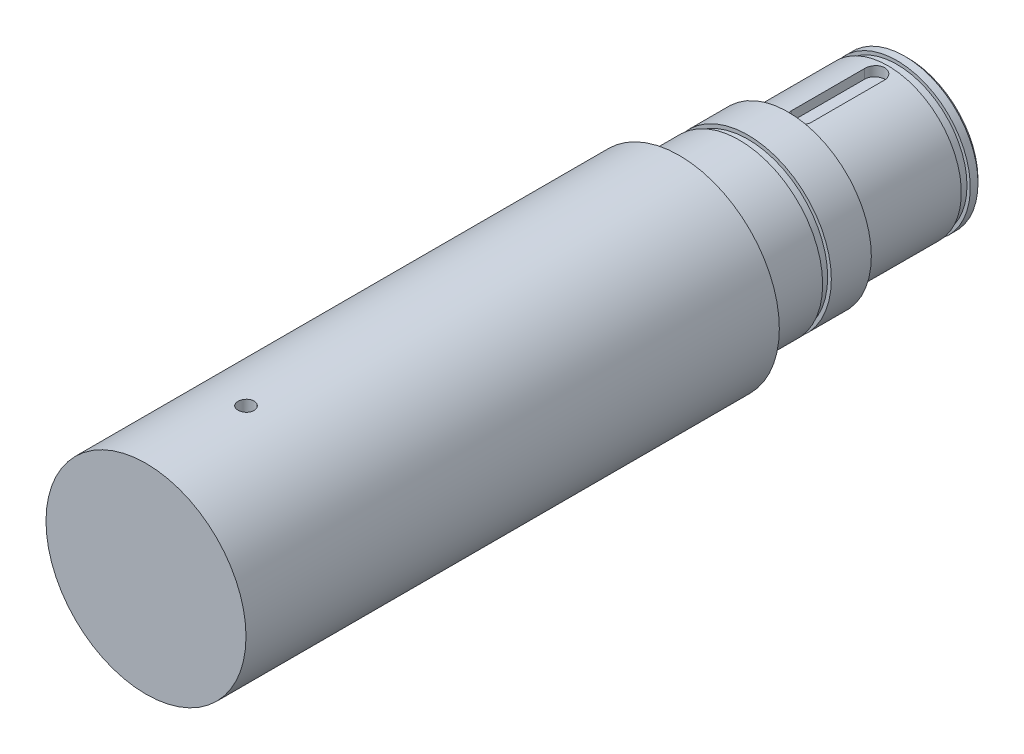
from build123d import *

# Parameters (mm, degrees)
ESQUISSE1_R             = 11
EXTRUSION1_DEPTH        = 18
ESQUISSE5_R             = 12.5
EXTRUSION5_DEPTH        = 6
ESQUISSE6_R             = 11.95
EXTRUSION6_DEPTH        = 1.3
ESQUISSE7_R             = 12.5
EXTRUSION7_DEPTH        = 9
ESQUISSE8_R             = 15
EXTRUSION8_DEPTH        = 80
ESQUISSE9_OUTSIDE_W     = 56.384
ESQUISSE9_OUTSIDE_H     = 56.384
ESQUISSE9_OUTSIDE_R     = 10.5
ENL_V_MAT_EXTRU_1_DEPTH = 1.35
CHANFREIN1_SIZE         = 0.5
ENL_V_MAT_EXTRU_2_DEPTH = 1.5
D_GAGEMENT_M21_D        = 2.4
D_GAGEMENT_M21_DEPTH    = 70
D_GAGEMENT_M21_TIP      = 0.721032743


with BuildPart() as part:
    # Esquisse1 → Extrusion1 (new body)
    with BuildSketch(Plane.XY):
        Circle(ESQUISSE1_R)
    extrude(amount=EXTRUSION1_DEPTH)

    # Esquisse5 → Extrusion5 (add)
    with BuildSketch(Plane.XY.offset(18)):
        Circle(ESQUISSE5_R)
    extrude(amount=EXTRUSION5_DEPTH)

    # Esquisse6 → Extrusion6 (add)
    with BuildSketch(Plane.XY.offset(24)):
        Circle(ESQUISSE6_R)
    extrude(amount=EXTRUSION6_DEPTH)

    # Esquisse7 → Extrusion7 (add)
    with BuildSketch(Plane.XY.offset(25.3)):
        Circle(ESQUISSE7_R)
    extrude(amount=EXTRUSION7_DEPTH)

    # Esquisse8 → Extrusion8 (add)
    with BuildSketch(Plane.XY.offset(34.3)):
        Circle(ESQUISSE8_R)
    extrude(amount=EXTRUSION8_DEPTH)

    # Esquisse9 outside → Enl_v. mat.-Extru.1 (cut)
    with BuildSketch(Plane(origin=(0, 0, 3), x_dir=(-1, 0, 0), z_dir=(0, 0, -1))):
        Rectangle(ESQUISSE9_OUTSIDE_W, ESQUISSE9_OUTSIDE_H)
        with Locations(Location((0, 0, 0), (0, 0, 180))):
            Circle(ESQUISSE9_OUTSIDE_R, mode=Mode.SUBTRACT)
    extrude(amount=ENL_V_MAT_EXTRU_1_DEPTH, mode=Mode.SUBTRACT)

    # Chanfrein1
    chanfrein1_edges = [part.edges().sort_by_distance(p)[0] for p in [
        (-11, 0, 0),
    ]]
    chamfer(chanfrein1_edges, length=CHANFREIN1_SIZE)

    # Esquisse10 → Enl_v. mat.-Extru.2 (cut)
    with BuildSketch(Plane(origin=(0, 11, 0), x_dir=(-1, 0, 0), z_dir=(0, 1, 0))):
        with BuildLine():
            Line((-1.5, 5), (-1.5, 16))
            ThreePointArc((-1.5, 16), (0, 17.5), (1.5, 16))
            Line((1.5, 16), (1.5, 5))
            ThreePointArc((1.5, 5), (0, 3.5), (-1.5, 5))
        make_face()
    extrude(amount=-ENL_V_MAT_EXTRU_2_DEPTH, mode=Mode.SUBTRACT)

    # D_gagement M21
    with Locations(Plane(origin=(0, 15, 0), x_dir=(-1, 0, 0), z_dir=(0, 1, 0))):
        with Locations((0, 99.3)):
            Hole(D_GAGEMENT_M21_D / 2, depth=D_GAGEMENT_M21_DEPTH)
            with Locations((0, 0, -(D_GAGEMENT_M21_DEPTH + D_GAGEMENT_M21_TIP / 2))):  # 118° drill point
                Cone(0, D_GAGEMENT_M21_D / 2, D_GAGEMENT_M21_TIP, mode=Mode.SUBTRACT)


solid = part.part
